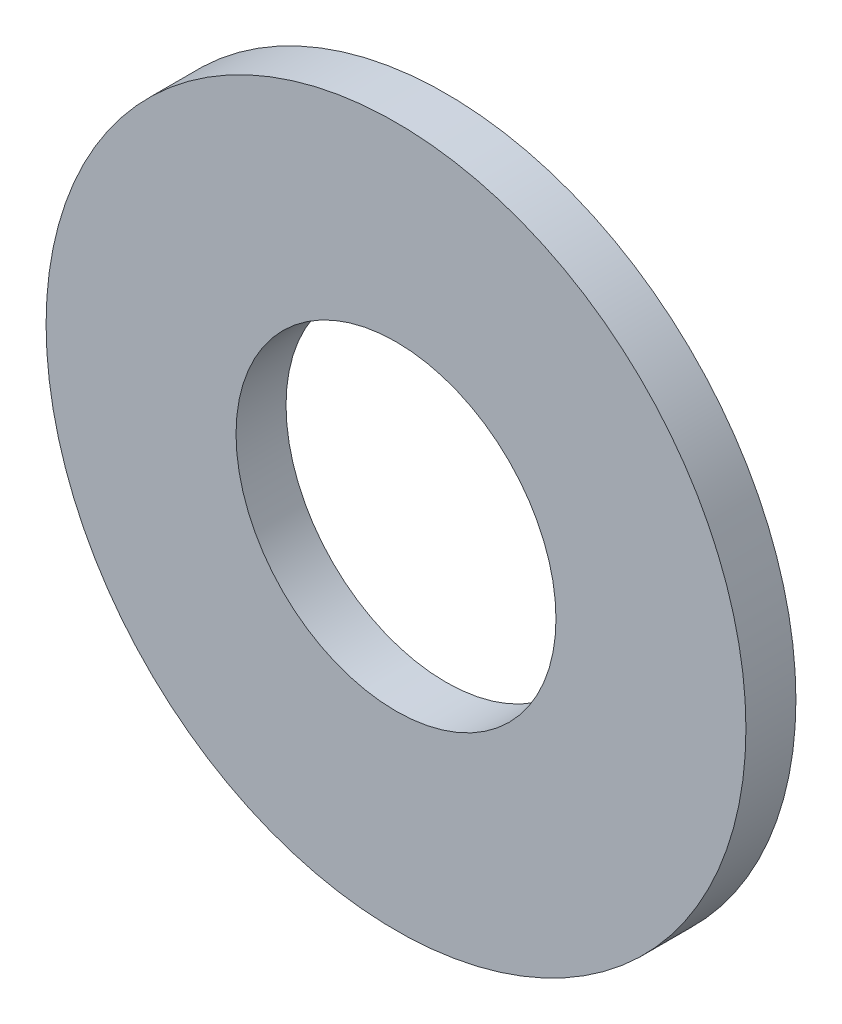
from build123d import *

# Parameters (mm, degrees)
SKETCH1_R               = 3.5
BOSS_EXTRUDE1_DEPTH     = 0.5
CUT_EXTRUDE1_DEPTH      = 5.974937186
CUT_EXTRUDE1_DEPTH_BACK = 5.974937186
SKETCH2_R               = 1.6


with BuildPart() as part:
    # Sketch1 → Boss-Extrude1 (new body)
    with BuildSketch(Plane.XY):
        Circle(SKETCH1_R)
    extrude(amount=-BOSS_EXTRUDE1_DEPTH)

    # Sketch2 → Cut-Extrude1 (cut, two sides: drawn at the far end of the back side and taken through both)
    with BuildSketch(Plane.XY.offset(-CUT_EXTRUDE1_DEPTH_BACK)):
        Circle(SKETCH2_R)
    extrude(amount=CUT_EXTRUDE1_DEPTH + CUT_EXTRUDE1_DEPTH_BACK, mode=Mode.SUBTRACT)


solid = part.part
